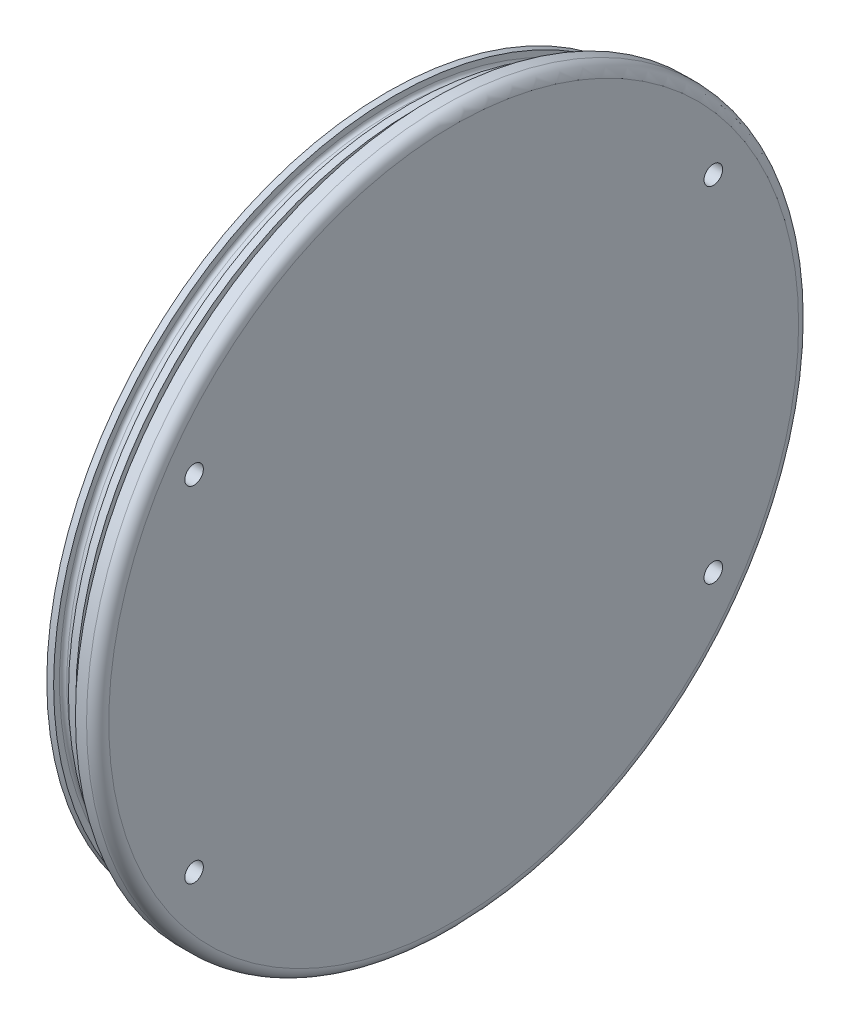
from build123d import *

# Parameters (mm, degrees)
F_3_8_16_TAPPED_HOLE1_D     = 7.9375
F_3_8_16_TAPPED_HOLE1_DEPTH = 12.7
FILLET16_R                  = 4.7625
FILLET17_R                  = 1.5875


with BuildPart() as part:
    # Sketch1 → Revolve1 (revolve)
    with BuildSketch(Plane.XY, mode=Mode.PRIVATE) as revolve1_sk:
        Polygon((0, 145.6055), (0, 152.4), (9.525, 152.4), (9.525, 0), (-19.05, 0), (-19.05, 145.6055), (-16.129, 145.6055), (-16.129, 141.4907), (-9.779, 141.4907), (-9.779, 145.6055), (-6.604, 145.6055), (-6.604, 141.4907), (-0.254, 141.4907), (-0.254, 145.6055), align=None)
    revolve(revolve1_sk.sketch.rotate(Axis((0, 0, 0), (-1, 0, 0)), 90), axis=Axis((0, 0, 0), (-1, 0, 0)))

    # 3_8-16 Tapped Hole1
    with Locations(Plane(origin=(9.525, 0, 0), x_dir=(0, 0, -1), z_dir=(1, 0, 0))):
        with Locations((111.125, -73.711985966), (-111.125, -73.711985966), (-111.125, 73.711985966), (111.125, 73.711985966)):
            Hole(F_3_8_16_TAPPED_HOLE1_D / 2, depth=F_3_8_16_TAPPED_HOLE1_DEPTH)

    # Fillet16
    fillet16_edges = [part.edges().sort_by_distance(p)[0] for p in [
        (9.525, 0, 152.4),
    ]]
    fillet(fillet16_edges, radius=FILLET16_R)

    # Fillet17
    fillet17_edges = [part.edges().sort_by_distance(p)[0] for p in [
        (-16.129, 0, 141.4907),
        (-9.779, 0, 141.4907),
        (-6.604, 0, 141.4907),
        (-0.254, 0, 141.4907),
    ]]
    fillet(fillet17_edges, radius=FILLET17_R)


solid = part.part
